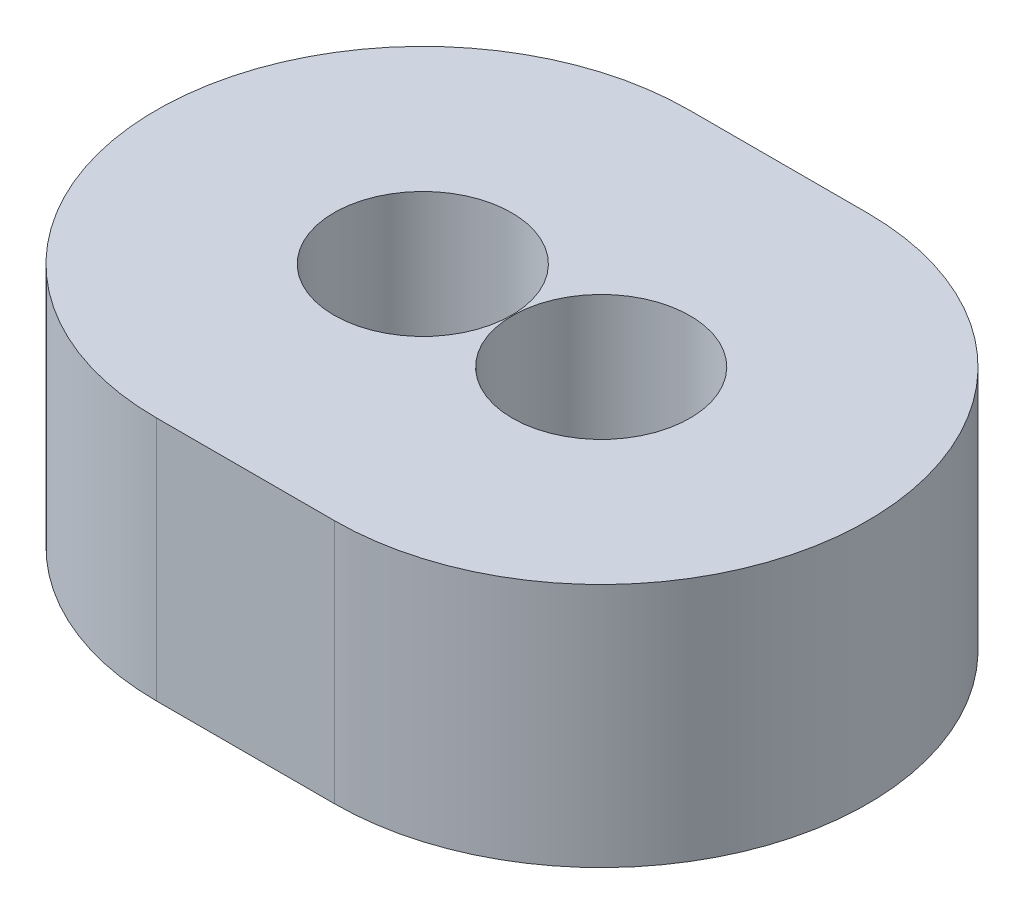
from build123d import *

# Parameters (mm, degrees)
SKETCH1_R           = 3.175
BOSS_EXTRUDE1_DEPTH = 8.763


with BuildPart() as part:
    # Sketch1 → Boss-Extrude1 (new body)
    with BuildSketch(Plane(origin=(0, 0, 0), x_dir=(1, 0, 0), z_dir=(0, 1, 0))):
        with BuildLine():
            Line((-3.1877, 9.525), (3.1877, 9.525))
            ThreePointArc((3.1877, 9.525), (12.7127, 0), (3.1877, -9.525))
            Line((3.1877, -9.525), (-3.1877, -9.525))
            ThreePointArc((-3.1877, -9.525), (-12.7127, 0), (-3.1877, 9.525))
        make_face()
        with Locations(Location((-3.1877, 0, 0), (0, 0, 270))):
            Circle(SKETCH1_R, mode=Mode.SUBTRACT)
        with Locations(Location((3.1877, 0, 0), (0, 0, 270))):
            Circle(SKETCH1_R, mode=Mode.SUBTRACT)
    extrude(amount=BOSS_EXTRUDE1_DEPTH)


solid = part.part
